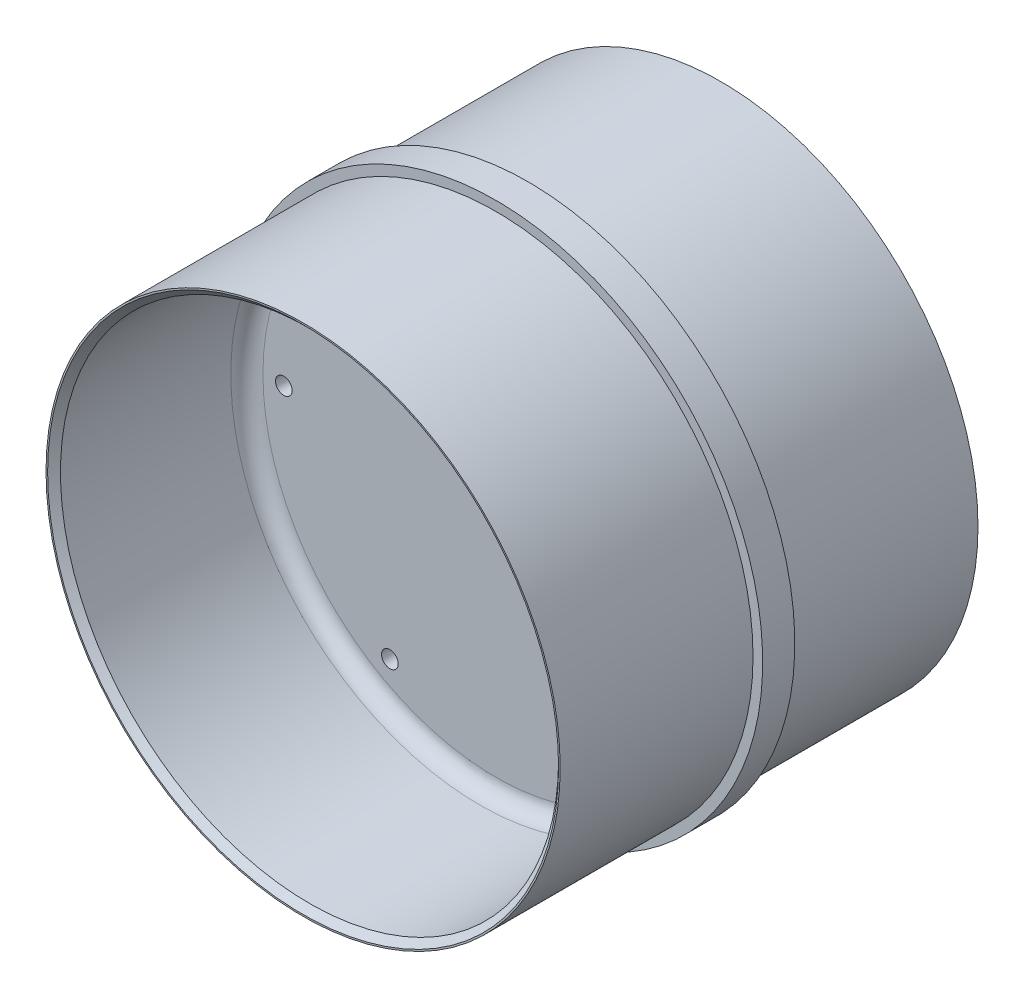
from build123d import *

# Parameters (mm, degrees)
CHAMFER1_SIZE              = 2
CHAMFER2_SIZE              = 2
F_6_0_204_DIAMETER_HOLE1_D = 5.1816
CIRPATTERN1_COUNT          = 6
FILLET2_R                  = 5
FILLET3_R                  = 5


with BuildPart() as part:
    # Sketch2 → Revolve1 (revolve)
    with BuildSketch(Plane(origin=(0, 0, 0), x_dir=(0, 0, -1), z_dir=(1, 0, 0)), mode=Mode.PRIVATE) as revolve1_sk:
        Polygon((-5, 0), (-5, 77.5), (-65, 77.5), (-65, 80), (-5, 80), (-5, 83), (5, 83), (5, 80), (65, 80), (65, 77.5), (5, 77.5), (5, 0), align=None)
    revolve(revolve1_sk.sketch.rotate(Axis((0, 0, -77), (0, 0, 1)), 90), axis=Axis((0, 0, -77), (0, 0, 1)))

    # Chamfer1
    chamfer1_edges = [part.edges().sort_by_distance(p)[0] for p in [
        (77.5, 0, -65),
    ]]
    chamfer(chamfer1_edges, length=CHAMFER1_SIZE)

    # Chamfer2
    chamfer2_edges = [part.edges().sort_by_distance(p)[0] for p in [
        (77.5, 0, 65),
    ]]
    chamfer(chamfer2_edges, length=CHAMFER2_SIZE)

    # 6 _0.204_ Diameter Hole1 (through all)
    with Locations(Plane.XY.offset(5)):
        with Locations((-33, 57.15767665)):
            f_6_0_204_diameter_hole1 = Hole(F_6_0_204_DIAMETER_HOLE1_D / 2)

    # CirPattern1: 6 _0.204_ Diameter Hole1 ×6 about axis
    cirpattern1_axis = Axis((0, 0, 0), (0, 0, 1))
    for i in range(1, CIRPATTERN1_COUNT):
        add(f_6_0_204_diameter_hole1.rotate(cirpattern1_axis, i * 360 / CIRPATTERN1_COUNT), mode=Mode.SUBTRACT)

    # Fillet2
    fillet2_edges = [part.edges().sort_by_distance(p)[0] for p in [
        (77.5, 0, -5),
    ]]
    fillet(fillet2_edges, radius=FILLET2_R)

    # Fillet3
    fillet3_edges = [part.edges().sort_by_distance(p)[0] for p in [
        (77.5, 0, 5),
    ]]
    fillet(fillet3_edges, radius=FILLET3_R)


solid = part.part
